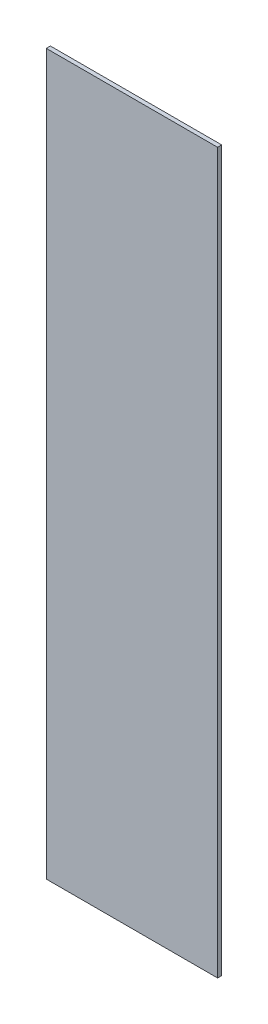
from build123d import *

# Parameters (mm, degrees)
ESBO_O1_W                = 250
ESBO_O1_H                = 1050
RESSALTO_EXTRUS_O1_DEPTH = 6


with BuildPart() as part:
    # Esbo_o1 → Ressalto-extrus_o1 (new body)
    with BuildSketch(Plane.XY):
        with Locations((125, 525)):
            Rectangle(ESBO_O1_W, ESBO_O1_H)
    extrude(amount=RESSALTO_EXTRUS_O1_DEPTH)


solid = part.part
